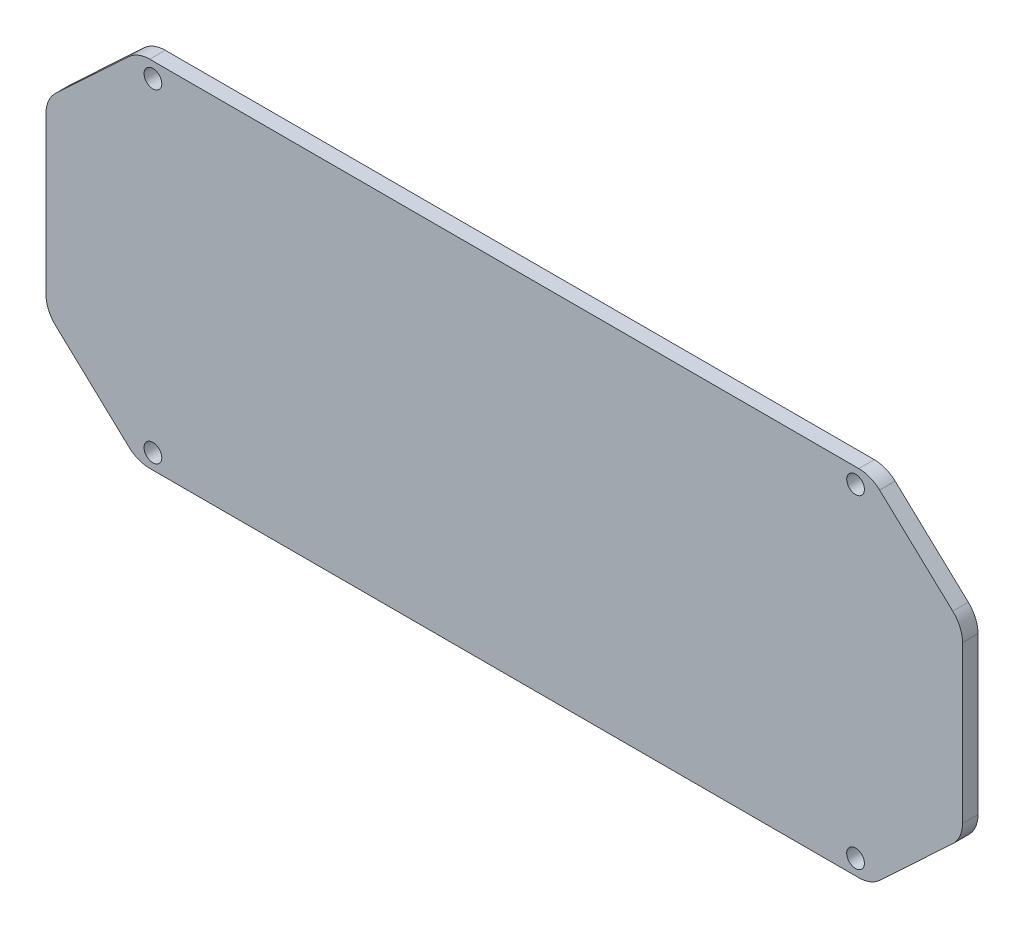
from build123d import *

# Parameters (mm, degrees)
SKETCH1_R           = 1.45
BOSS_EXTRUDE1_DEPTH = 2.54
FILLET1_R           = 5


with BuildPart() as part:
    # Sketch1 → Boss-Extrude1 (new body)
    with BuildSketch(Plane.XY):
        Polygon((-60, 29), (-75, 15), (-75, -15), (-60, -29), (60, -29), (75, -15), (75, 15), (60, 29), align=None)
        with Locations((-57.5, 26.5)):
            Circle(SKETCH1_R, mode=Mode.SUBTRACT)
        with Locations((-57.5, -26.5)):
            Circle(SKETCH1_R, mode=Mode.SUBTRACT)
        with Locations((57.5, 26.5)):
            Circle(SKETCH1_R, mode=Mode.SUBTRACT)
        with Locations((57.5, -26.5)):
            Circle(SKETCH1_R, mode=Mode.SUBTRACT)
    extrude(amount=BOSS_EXTRUDE1_DEPTH)

    # Fillet1
    fillet1_edges = [part.edges().sort_by_distance(p)[0] for p in [
        (-75, -15, 1.27),
        (-75, 15, 1.27),
        (-60, 29, 1.27),
        (60, 29, 1.27),
        (75, 15, 1.27),
        (75, -15, 1.27),
        (60, -29, 1.27),
        (-60, -29, 1.27),
    ]]
    fillet(fillet1_edges, radius=FILLET1_R)


solid = part.part
